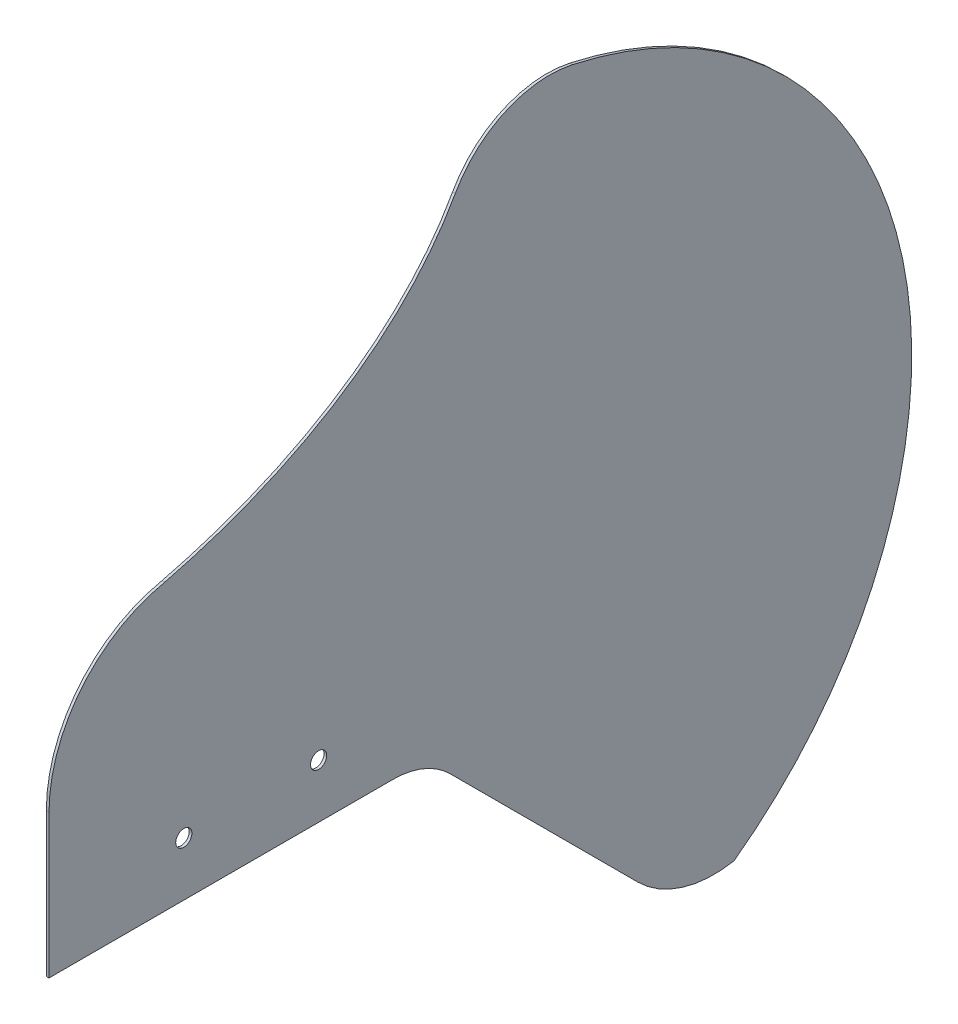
from build123d import *

# Parameters (mm, degrees)
ESQUISSE1_R      = 1.5
EXTRUSION1_DEPTH = 0.5


with BuildPart() as part:
    # Esquisse1 → Extrusion1 (new body)
    with BuildSketch(Plane(origin=(0, 0, 0), x_dir=(0, 0, -1), z_dir=(1, 0, 0))):
        with BuildLine():
            Line((-80, 0), (-80, -20))
            Line((-80, -20), (-16.213203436, -20))
            ThreePointArc((-16.213203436, -20), (-10.47295195, -21.141807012), (-5.606601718, -24.393398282))
            Line((-5.606601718, -24.393398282), (29.19556813, -59.19556813))
            ThreePointArc((29.19556813, -59.19556813), (37.435848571, -64.162804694), (47.042049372, -64.707384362))
            ThreePointArc((47.042049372, -64.707384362), (78.29883969, 16.410109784), (17.101402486, 78.150764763))
            ThreePointArc((17.101402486, 78.150764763), (4.599244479, 76.842709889), (-4.65301688, 68.333266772))
            add(Edge.make_bspline(
                [(-58.539505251, 32.847376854), (-46.324146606, 35.872326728), (-24.162641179, 45.016642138), (-9.434755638, 59.734637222), (-4.65301688, 68.333266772)],
                knots=[0, 0, 0, 0, 0.345585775, 0.691171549, 0.691171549, 0.691171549, 0.691171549], degree=3))
            ThreePointArc((-58.539505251, 32.847376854), (-73.950985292, 23.56675832), (-80, 6.624119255))
            Line((-80, 6.624119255), (-80, 0))
        make_face()
        with Locations((-55, -10)):
            Circle(ESQUISSE1_R, mode=Mode.SUBTRACT)
        with Locations((-30, -10)):
            Circle(ESQUISSE1_R, mode=Mode.SUBTRACT)
    extrude(amount=EXTRUSION1_DEPTH)


solid = part.part
